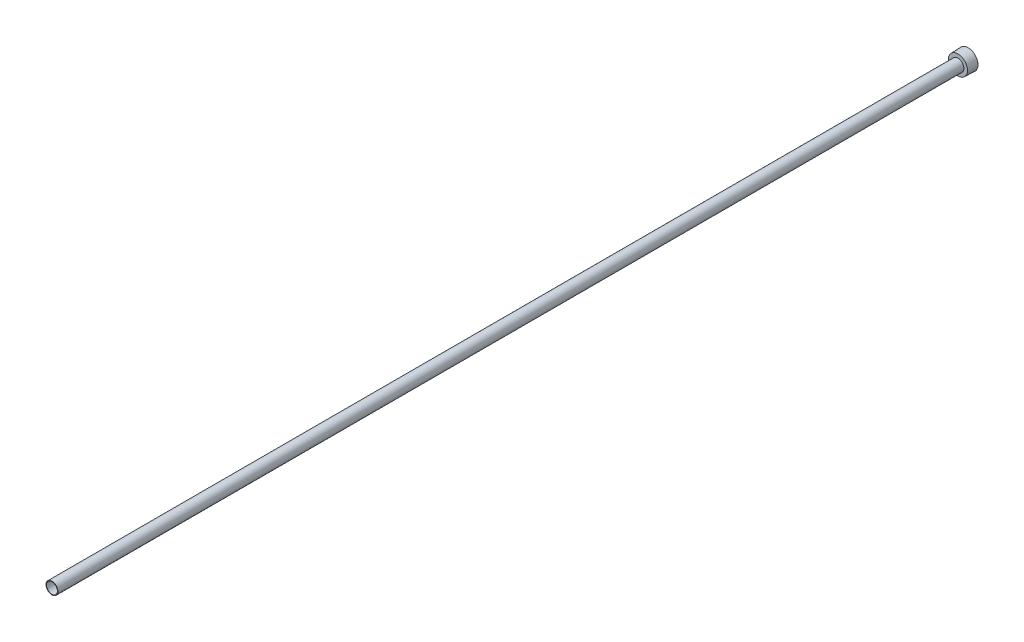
ISO-10303-21;
HEADER;
FILE_DESCRIPTION(('STEP AP214'),'2;1');
FILE_NAME('part.step','',(''),(''),'','','');
FILE_SCHEMA(('AUTOMOTIVE_DESIGN { 1 0 10303 214 1 1 1 1 }'));
ENDSEC;
DATA;
#1=APPLICATION_CONTEXT('core data for automotive mechanical design processes');
#2=APPLICATION_PROTOCOL_DEFINITION('international standard','automotive_design',2000,#1);
#3=PRODUCT_CONTEXT('',#1,'mechanical');
#4=PRODUCT('Part','Part','',(#3));
#5=PRODUCT_RELATED_PRODUCT_CATEGORY('part','',(#4));
#6=PRODUCT_DEFINITION_FORMATION('','',#4);
#7=PRODUCT_DEFINITION_CONTEXT('part definition',#1,'design');
#8=PRODUCT_DEFINITION('design','',#6,#7);
#9=PRODUCT_DEFINITION_SHAPE('','',#8);
#10=(LENGTH_UNIT() NAMED_UNIT(*) SI_UNIT(.MILLI.,.METRE.));
#11=(NAMED_UNIT(*) PLANE_ANGLE_UNIT() SI_UNIT($,.RADIAN.));
#12=(NAMED_UNIT(*) SI_UNIT($,.STERADIAN.) SOLID_ANGLE_UNIT());
#13=UNCERTAINTY_MEASURE_WITH_UNIT(LENGTH_MEASURE(1.E-05),#10,'distance_accuracy_value','');
#14=(GEOMETRIC_REPRESENTATION_CONTEXT(3) GLOBAL_UNCERTAINTY_ASSIGNED_CONTEXT((#13)) GLOBAL_UNIT_ASSIGNED_CONTEXT((#10,
#11,#12)) REPRESENTATION_CONTEXT('',''));
#15=CARTESIAN_POINT('',(0.,0.,0.));
#16=DIRECTION('',(0.,0.,1.));
#17=DIRECTION('',(1.,0.,0.));
#18=AXIS2_PLACEMENT_3D('',#15,#16,#17);
#19=CARTESIAN_POINT('',(0.,0.,0.));
#20=DIRECTION('',(0.,0.,1.));
#21=DIRECTION('',(1.,0.,0.));
#22=AXIS2_PLACEMENT_3D('',#19,#20,#21);
#23=CYLINDRICAL_SURFACE('',#22,7.2263);
#24=CARTESIAN_POINT('',(0.,0.,1219.2));
#25=DIRECTION('',(0.,0.,1.));
#26=DIRECTION('',(1.,0.,0.));
#27=AXIS2_PLACEMENT_3D('',#24,#25,#26);
#28=CIRCLE('',#27,7.2263);
#29=CARTESIAN_POINT('',(7.2263,0.,1219.2));
#30=VERTEX_POINT('',#29);
#31=EDGE_CURVE('E142',#30,#30,#28,.T.);
#32=CARTESIAN_POINT('',(0.,0.,9.525));
#33=DIRECTION('',(0.,0.,-1.));
#34=DIRECTION('',(-1.,0.,0.));
#35=AXIS2_PLACEMENT_3D('',#32,#33,#34);
#36=CIRCLE('',#35,7.2263);
#37=CARTESIAN_POINT('',(7.2263,0.,9.525));
#38=VERTEX_POINT('',#37);
#39=EDGE_CURVE('E37',#38,#38,#36,.F.);
#40=CARTESIAN_POINT('',(7.2263,0.,1219.2));
#41=CARTESIAN_POINT('',(7.2263,0.,1206.59921875));
#42=CARTESIAN_POINT('',(7.2263,0.,1193.9984375));
#43=CARTESIAN_POINT('',(7.2263,0.,1168.796875));
#44=CARTESIAN_POINT('',(7.2263,0.,1156.19609375));
#45=CARTESIAN_POINT('',(7.2263,0.,1130.99453125));
#46=CARTESIAN_POINT('',(7.2263,0.,1118.39375));
#47=CARTESIAN_POINT('',(7.2263,0.,1093.1921875));
#48=CARTESIAN_POINT('',(7.2263,0.,1080.59140625));
#49=CARTESIAN_POINT('',(7.2263,0.,1055.38984375));
#50=CARTESIAN_POINT('',(7.2263,0.,1042.7890625));
#51=CARTESIAN_POINT('',(7.2263,0.,1017.5875));
#52=CARTESIAN_POINT('',(7.2263,0.,1004.98671875));
#53=CARTESIAN_POINT('',(7.2263,0.,979.78515625));
#54=CARTESIAN_POINT('',(7.2263,0.,967.184375));
#55=CARTESIAN_POINT('',(7.2263,0.,941.9828125));
#56=CARTESIAN_POINT('',(7.2263,0.,929.38203125));
#57=CARTESIAN_POINT('',(7.2263,0.,904.18046875));
#58=CARTESIAN_POINT('',(7.2263,0.,891.5796875));
#59=CARTESIAN_POINT('',(7.2263,0.,866.378125));
#60=CARTESIAN_POINT('',(7.2263,0.,853.77734375));
#61=CARTESIAN_POINT('',(7.2263,0.,828.57578125));
#62=CARTESIAN_POINT('',(7.2263,0.,815.975));
#63=CARTESIAN_POINT('',(7.2263,0.,790.7734375));
#64=CARTESIAN_POINT('',(7.2263,0.,778.17265625));
#65=CARTESIAN_POINT('',(7.2263,0.,752.97109375));
#66=CARTESIAN_POINT('',(7.2263,0.,740.3703125));
#67=CARTESIAN_POINT('',(7.2263,0.,715.16875));
#68=CARTESIAN_POINT('',(7.2263,0.,702.56796875));
#69=CARTESIAN_POINT('',(7.2263,0.,677.36640625));
#70=CARTESIAN_POINT('',(7.2263,0.,664.765625));
#71=CARTESIAN_POINT('',(7.2263,0.,639.5640625));
#72=CARTESIAN_POINT('',(7.2263,0.,626.96328125));
#73=CARTESIAN_POINT('',(7.2263,0.,601.76171875));
#74=CARTESIAN_POINT('',(7.2263,0.,589.1609375));
#75=CARTESIAN_POINT('',(7.2263,0.,563.959375));
#76=CARTESIAN_POINT('',(7.2263,0.,551.35859375));
#77=CARTESIAN_POINT('',(7.2263,0.,526.15703125));
#78=CARTESIAN_POINT('',(7.2263,0.,513.55625));
#79=CARTESIAN_POINT('',(7.2263,0.,488.3546875));
#80=CARTESIAN_POINT('',(7.2263,0.,475.75390625));
#81=CARTESIAN_POINT('',(7.2263,0.,450.55234375));
#82=CARTESIAN_POINT('',(7.2263,0.,437.9515625));
#83=CARTESIAN_POINT('',(7.2263,0.,412.75));
#84=CARTESIAN_POINT('',(7.2263,0.,400.14921875));
#85=CARTESIAN_POINT('',(7.2263,0.,374.94765625));
#86=CARTESIAN_POINT('',(7.2263,0.,362.346875));
#87=CARTESIAN_POINT('',(7.2263,0.,337.1453125));
#88=CARTESIAN_POINT('',(7.2263,0.,324.54453125));
#89=CARTESIAN_POINT('',(7.2263,0.,299.34296875));
#90=CARTESIAN_POINT('',(7.2263,0.,286.7421875));
#91=CARTESIAN_POINT('',(7.2263,0.,261.540625));
#92=CARTESIAN_POINT('',(7.2263,0.,248.93984375));
#93=CARTESIAN_POINT('',(7.2263,0.,223.73828125));
#94=CARTESIAN_POINT('',(7.2263,0.,211.1375));
#95=CARTESIAN_POINT('',(7.2263,0.,185.9359375));
#96=CARTESIAN_POINT('',(7.2263,0.,173.33515625));
#97=CARTESIAN_POINT('',(7.2263,0.,148.13359375));
#98=CARTESIAN_POINT('',(7.2263,0.,135.5328125));
#99=CARTESIAN_POINT('',(7.2263,0.,110.33125));
#100=CARTESIAN_POINT('',(7.2263,0.,97.73046875));
#101=CARTESIAN_POINT('',(7.2263,0.,72.52890625));
#102=CARTESIAN_POINT('',(7.2263,0.,59.928125));
#103=CARTESIAN_POINT('',(7.2263,0.,34.7265624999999));
#104=CARTESIAN_POINT('',(7.2263,0.,22.12578125));
#105=CARTESIAN_POINT('',(7.2263,0.,9.525));
#106=B_SPLINE_CURVE_WITH_KNOTS('',3,(#40,#41,#42,#43,#44,#45,#46,#47,#48,#49,#50,#51,#52,#53,
#54,#55,#56,#57,#58,#59,#60,#61,#62,#63,#64,#65,#66,#67,#68,#69,#70,#71,#72,#73,#74,#75,#76,#77,
#78,#79,#80,#81,#82,#83,#84,#85,#86,#87,#88,#89,#90,#91,#92,#93,#94,#95,#96,#97,#98,#99,#100,
#101,#102,#103,#104,#105),.UNSPECIFIED.,.F.,.F.,(4,2,2,2,2,2,2,2,2,2,2,2,2,2,2,2,2,2,2,2,2,2,2,
2,2,2,2,2,2,2,2,2,4),(0.,37.8023437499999,75.6046875,113.40703125,151.209375,189.01171875,
226.8140625,264.61640625,302.41875,340.22109375,378.0234375,415.82578125,453.628125,
491.43046875,529.2328125,567.03515625,604.8375,642.63984375,680.4421875,718.24453125,756.046875,
793.84921875,831.6515625,869.45390625,907.25625,945.05859375,982.8609375,1020.66328125,
1058.465625,1096.26796875,1134.0703125,1171.87265625,1209.675),.UNSPECIFIED.);
#107=EDGE_CURVE('BSEAM33',#30,#38,#106,.T.);
#108=ORIENTED_EDGE('',*,*,#31,.T.);
#109=ORIENTED_EDGE('',*,*,#39,.F.);
#110=ORIENTED_EDGE('',*,*,#107,.T.);
#111=ORIENTED_EDGE('',*,*,#107,.F.);
#112=EDGE_LOOP('',(#108,#110,#109,#111));
#113=FACE_BOUND('',#112,.T.);
#114=ADVANCED_FACE('F33',(#113),#23,.F.);
#115=CARTESIAN_POINT('',(0.,7.93749999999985,1219.2));
#116=DIRECTION('',(0.,0.,-1.));
#117=DIRECTION('',(-1.,0.,0.));
#118=AXIS2_PLACEMENT_3D('',#115,#116,#117);
#119=PLANE('',#118);
#120=ORIENTED_EDGE('',*,*,#31,.F.);
#121=EDGE_LOOP('',(#120));
#122=FACE_BOUND('',#121,.T.);
#123=CARTESIAN_POINT('',(0.,0.,1219.2));
#124=DIRECTION('',(0.,0.,1.));
#125=DIRECTION('',(1.,0.,0.));
#126=AXIS2_PLACEMENT_3D('',#123,#124,#125);
#127=CIRCLE('',#126,7.93749999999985);
#128=CARTESIAN_POINT('',(7.93749999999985,0.,1219.2));
#129=VERTEX_POINT('',#128);
#130=EDGE_CURVE('E145',#129,#129,#127,.T.);
#131=ORIENTED_EDGE('',*,*,#130,.T.);
#132=EDGE_LOOP('',(#131));
#133=FACE_BOUND('',#132,.T.);
#134=ADVANCED_FACE('F35',(#122,#133),#119,.F.);
#135=CARTESIAN_POINT('',(0.,0.,0.));
#136=DIRECTION('',(0.,0.,1.));
#137=DIRECTION('',(1.,0.,0.));
#138=AXIS2_PLACEMENT_3D('',#135,#136,#137);
#139=PLANE('',#138);
#140=DIRECTION('',(-0.866025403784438,0.5,0.));
#141=VECTOR('',#140,1.);
#142=CARTESIAN_POINT('',(0.,-10.9985226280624,0.));
#143=LINE('',#142,#141);
#144=CARTESIAN_POINT('',(0.,-10.9985226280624,0.));
#145=VERTEX_POINT('',#144);
#146=CARTESIAN_POINT('',(-9.525,-5.49926131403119,0.));
#147=VERTEX_POINT('',#146);
#148=EDGE_CURVE('E124',#145,#147,#143,.T.);
#149=ORIENTED_EDGE('',*,*,#148,.F.);
#150=DIRECTION('',(-0.866025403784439,-0.5,0.));
#151=VECTOR('',#150,1.);
#152=CARTESIAN_POINT('',(9.525,-5.49926131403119,0.));
#153=LINE('',#152,#151);
#154=CARTESIAN_POINT('',(9.525,-5.49926131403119,0.));
#155=VERTEX_POINT('',#154);
#156=EDGE_CURVE('E49',#155,#145,#153,.T.);
#157=ORIENTED_EDGE('',*,*,#156,.F.);
#158=DIRECTION('',(0.,-1.,0.));
#159=VECTOR('',#158,1.);
#160=CARTESIAN_POINT('',(9.525,5.49926131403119,0.));
#161=LINE('',#160,#159);
#162=CARTESIAN_POINT('',(9.525,5.49926131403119,0.));
#163=VERTEX_POINT('',#162);
#164=EDGE_CURVE('E133',#163,#155,#161,.T.);
#165=ORIENTED_EDGE('',*,*,#164,.F.);
#166=DIRECTION('',(0.866025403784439,-0.5,0.));
#167=VECTOR('',#166,1.);
#168=CARTESIAN_POINT('',(0.,10.9985226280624,0.));
#169=LINE('',#168,#167);
#170=CARTESIAN_POINT('',(0.,10.9985226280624,0.));
#171=VERTEX_POINT('',#170);
#172=EDGE_CURVE('E131',#171,#163,#169,.T.);
#173=ORIENTED_EDGE('',*,*,#172,.F.);
#174=DIRECTION('',(0.866025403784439,0.5,0.));
#175=VECTOR('',#174,1.);
#176=CARTESIAN_POINT('',(-9.525,5.49926131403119,0.));
#177=LINE('',#176,#175);
#178=CARTESIAN_POINT('',(-9.525,5.49926131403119,0.));
#179=VERTEX_POINT('',#178);
#180=EDGE_CURVE('E97',#179,#171,#177,.T.);
#181=ORIENTED_EDGE('',*,*,#180,.F.);
#182=DIRECTION('',(0.,1.,0.));
#183=VECTOR('',#182,1.);
#184=CARTESIAN_POINT('',(-9.525,-5.49926131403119,0.));
#185=LINE('',#184,#183);
#186=EDGE_CURVE('E127',#147,#179,#185,.T.);
#187=ORIENTED_EDGE('',*,*,#186,.F.);
#188=EDGE_LOOP('',(#149,#157,#165,#173,#181,#187));
#189=FACE_BOUND('',#188,.T.);
#190=CARTESIAN_POINT('',(0.,0.,0.));
#191=DIRECTION('',(0.,0.,1.));
#192=DIRECTION('',(1.,0.,0.));
#193=AXIS2_PLACEMENT_3D('',#190,#191,#192);
#194=CIRCLE('',#193,13.2207);
#195=CARTESIAN_POINT('',(13.2207,0.,0.));
#196=VERTEX_POINT('',#195);
#197=EDGE_CURVE('E11',#196,#196,#194,.T.);
#198=ORIENTED_EDGE('',*,*,#197,.F.);
#199=EDGE_LOOP('',(#198));
#200=FACE_BOUND('',#199,.T.);
#201=ADVANCED_FACE('F159',(#189,#200),#139,.F.);
#202=CARTESIAN_POINT('',(0.,0.,0.));
#203=DIRECTION('',(0.,0.,-1.));
#204=DIRECTION('',(-1.,0.,0.));
#205=AXIS2_PLACEMENT_3D('',#202,#203,#204);
#206=CONICAL_SURFACE('',#205,13.2207,0.0364599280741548);
#207=CARTESIAN_POINT('',(0.,0.,13.4874));
#208=DIRECTION('',(0.,0.,1.));
#209=DIRECTION('',(1.,0.,0.));
#210=AXIS2_PLACEMENT_3D('',#207,#208,#209);
#211=CIRCLE('',#210,12.7287323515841);
#212=CARTESIAN_POINT('',(12.7287323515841,0.,13.4874));
#213=VERTEX_POINT('',#212);
#214=EDGE_CURVE('E42',#213,#213,#211,.T.);
#215=ORIENTED_EDGE('',*,*,#214,.F.);
#216=EDGE_LOOP('',(#215));
#217=FACE_BOUND('',#216,.T.);
#218=ORIENTED_EDGE('',*,*,#197,.T.);
#219=EDGE_LOOP('',(#218));
#220=FACE_BOUND('',#219,.T.);
#221=ADVANCED_FACE('F156',(#217,#220),#206,.T.);
#222=CARTESIAN_POINT('',(0.,12.7287323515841,13.4874));
#223=DIRECTION('',(0.,0.,-1.));
#224=DIRECTION('',(-1.,0.,0.));
#225=AXIS2_PLACEMENT_3D('',#222,#223,#224);
#226=PLANE('',#225);
#227=CARTESIAN_POINT('',(0.,0.,13.4874));
#228=DIRECTION('',(0.,0.,1.));
#229=DIRECTION('',(1.,0.,0.));
#230=AXIS2_PLACEMENT_3D('',#227,#228,#229);
#231=CIRCLE('',#230,7.9375);
#232=CARTESIAN_POINT('',(7.9375,0.,13.4874));
#233=VERTEX_POINT('',#232);
#234=EDGE_CURVE('E148',#233,#233,#231,.T.);
#235=ORIENTED_EDGE('',*,*,#234,.F.);
#236=EDGE_LOOP('',(#235));
#237=FACE_BOUND('',#236,.T.);
#238=ORIENTED_EDGE('',*,*,#214,.T.);
#239=EDGE_LOOP('',(#238));
#240=FACE_BOUND('',#239,.T.);
#241=ADVANCED_FACE('F154',(#237,#240),#226,.F.);
#242=CARTESIAN_POINT('',(0.,0.,278.00111462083));
#243=DIRECTION('',(0.,0.,1.));
#244=DIRECTION('',(1.,0.,0.));
#245=AXIS2_PLACEMENT_3D('',#242,#243,#244);
#246=CYLINDRICAL_SURFACE('',#245,7.93749999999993);
#247=ORIENTED_EDGE('',*,*,#130,.F.);
#248=EDGE_LOOP('',(#247));
#249=FACE_BOUND('',#248,.T.);
#250=ORIENTED_EDGE('',*,*,#234,.T.);
#251=EDGE_LOOP('',(#250));
#252=FACE_BOUND('',#251,.T.);
#253=ADVANCED_FACE('F180',(#249,#252),#246,.T.);
#254=CARTESIAN_POINT('',(0.,-10.9985226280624,9.525));
#255=DIRECTION('',(0.,0.,-1.));
#256=DIRECTION('',(-1.,0.,0.));
#257=AXIS2_PLACEMENT_3D('',#254,#255,#256);
#258=PLANE('',#257);
#259=DIRECTION('',(-0.866025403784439,-0.5,0.));
#260=VECTOR('',#259,1.);
#261=CARTESIAN_POINT('',(9.525,-5.49926131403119,9.525));
#262=LINE('',#261,#260);
#263=CARTESIAN_POINT('',(9.525,-5.49926131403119,9.525));
#264=VERTEX_POINT('',#263);
#265=CARTESIAN_POINT('',(0.,-10.9985226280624,9.525));
#266=VERTEX_POINT('',#265);
#267=EDGE_CURVE('E135',#264,#266,#262,.T.);
#268=ORIENTED_EDGE('',*,*,#267,.T.);
#269=DIRECTION('',(-0.866025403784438,0.5,0.));
#270=VECTOR('',#269,1.);
#271=CARTESIAN_POINT('',(0.,-10.9985226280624,9.525));
#272=LINE('',#271,#270);
#273=CARTESIAN_POINT('',(-9.525,-5.49926131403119,9.525));
#274=VERTEX_POINT('',#273);
#275=EDGE_CURVE('E118',#266,#274,#272,.T.);
#276=ORIENTED_EDGE('',*,*,#275,.T.);
#277=DIRECTION('',(0.,1.,0.));
#278=VECTOR('',#277,1.);
#279=CARTESIAN_POINT('',(-9.525,-5.49926131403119,9.525));
#280=LINE('',#279,#278);
#281=CARTESIAN_POINT('',(-9.525,5.49926131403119,9.525));
#282=VERTEX_POINT('',#281);
#283=EDGE_CURVE('E116',#274,#282,#280,.T.);
#284=ORIENTED_EDGE('',*,*,#283,.T.);
#285=DIRECTION('',(0.866025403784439,0.5,0.));
#286=VECTOR('',#285,1.);
#287=CARTESIAN_POINT('',(-9.525,5.49926131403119,9.525));
#288=LINE('',#287,#286);
#289=CARTESIAN_POINT('',(0.,10.9985226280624,9.525));
#290=VERTEX_POINT('',#289);
#291=EDGE_CURVE('E94',#282,#290,#288,.T.);
#292=ORIENTED_EDGE('',*,*,#291,.T.);
#293=DIRECTION('',(0.866025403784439,-0.5,0.));
#294=VECTOR('',#293,1.);
#295=CARTESIAN_POINT('',(0.,10.9985226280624,9.525));
#296=LINE('',#295,#294);
#297=CARTESIAN_POINT('',(9.525,5.49926131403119,9.525));
#298=VERTEX_POINT('',#297);
#299=EDGE_CURVE('E105',#290,#298,#296,.T.);
#300=ORIENTED_EDGE('',*,*,#299,.T.);
#301=DIRECTION('',(0.,-1.,0.));
#302=VECTOR('',#301,1.);
#303=CARTESIAN_POINT('',(9.525,5.49926131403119,9.525));
#304=LINE('',#303,#302);
#305=EDGE_CURVE('E109',#298,#264,#304,.T.);
#306=ORIENTED_EDGE('',*,*,#305,.T.);
#307=EDGE_LOOP('',(#268,#276,#284,#292,#300,#306));
#308=FACE_BOUND('',#307,.T.);
#309=ORIENTED_EDGE('',*,*,#39,.T.);
#310=EDGE_LOOP('',(#309));
#311=FACE_BOUND('',#310,.T.);
#312=ADVANCED_FACE('F112',(#308,#311),#258,.T.);
#313=CARTESIAN_POINT('',(9.525,-5.49926131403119,9.525));
#314=DIRECTION('',(0.5,-0.866025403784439,0.));
#315=DIRECTION('',(0.866025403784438,0.5,0.));
#316=AXIS2_PLACEMENT_3D('',#313,#314,#315);
#317=PLANE('',#316);
#318=ORIENTED_EDGE('',*,*,#156,.T.);
#319=DIRECTION('',(0.,0.,-1.));
#320=VECTOR('',#319,1.);
#321=CARTESIAN_POINT('',(0.,-10.9985226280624,9.525));
#322=LINE('',#321,#320);
#323=EDGE_CURVE('E79',#266,#145,#322,.T.);
#324=ORIENTED_EDGE('',*,*,#323,.F.);
#325=ORIENTED_EDGE('',*,*,#267,.F.);
#326=DIRECTION('',(0.,0.,-1.));
#327=VECTOR('',#326,1.);
#328=CARTESIAN_POINT('',(9.525,-5.49926131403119,9.525));
#329=LINE('',#328,#327);
#330=EDGE_CURVE('E57',#264,#155,#329,.T.);
#331=ORIENTED_EDGE('',*,*,#330,.T.);
#332=EDGE_LOOP('',(#318,#324,#325,#331));
#333=FACE_BOUND('',#332,.T.);
#334=ADVANCED_FACE('F178',(#333),#317,.F.);
#335=CARTESIAN_POINT('',(9.525,5.49926131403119,9.525));
#336=DIRECTION('',(1.,0.,0.));
#337=DIRECTION('',(0.,0.,-1.));
#338=AXIS2_PLACEMENT_3D('',#335,#336,#337);
#339=PLANE('',#338);
#340=ORIENTED_EDGE('',*,*,#164,.T.);
#341=ORIENTED_EDGE('',*,*,#330,.F.);
#342=ORIENTED_EDGE('',*,*,#305,.F.);
#343=DIRECTION('',(0.,0.,-1.));
#344=VECTOR('',#343,1.);
#345=CARTESIAN_POINT('',(9.525,5.49926131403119,9.525));
#346=LINE('',#345,#344);
#347=EDGE_CURVE('E101',#298,#163,#346,.T.);
#348=ORIENTED_EDGE('',*,*,#347,.T.);
#349=EDGE_LOOP('',(#340,#341,#342,#348));
#350=FACE_BOUND('',#349,.T.);
#351=ADVANCED_FACE('F209',(#350),#339,.F.);
#352=CARTESIAN_POINT('',(0.,10.9985226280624,9.525));
#353=DIRECTION('',(0.5,0.866025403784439,0.));
#354=DIRECTION('',(-0.866025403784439,0.5,0.));
#355=AXIS2_PLACEMENT_3D('',#352,#353,#354);
#356=PLANE('',#355);
#357=ORIENTED_EDGE('',*,*,#172,.T.);
#358=ORIENTED_EDGE('',*,*,#347,.F.);
#359=ORIENTED_EDGE('',*,*,#299,.F.);
#360=DIRECTION('',(0.,0.,-1.));
#361=VECTOR('',#360,1.);
#362=CARTESIAN_POINT('',(0.,10.9985226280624,9.525));
#363=LINE('',#362,#361);
#364=EDGE_CURVE('E90',#290,#171,#363,.T.);
#365=ORIENTED_EDGE('',*,*,#364,.T.);
#366=EDGE_LOOP('',(#357,#358,#359,#365));
#367=FACE_BOUND('',#366,.T.);
#368=ADVANCED_FACE('F106',(#367),#356,.F.);
#369=CARTESIAN_POINT('',(-9.525,5.49926131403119,9.525));
#370=DIRECTION('',(-0.5,0.866025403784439,0.));
#371=DIRECTION('',(-0.866025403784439,-0.5,0.));
#372=AXIS2_PLACEMENT_3D('',#369,#370,#371);
#373=PLANE('',#372);
#374=ORIENTED_EDGE('',*,*,#180,.T.);
#375=ORIENTED_EDGE('',*,*,#364,.F.);
#376=ORIENTED_EDGE('',*,*,#291,.F.);
#377=DIRECTION('',(0.,0.,-1.));
#378=VECTOR('',#377,1.);
#379=CARTESIAN_POINT('',(-9.525,5.49926131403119,9.525));
#380=LINE('',#379,#378);
#381=EDGE_CURVE('E102',#282,#179,#380,.T.);
#382=ORIENTED_EDGE('',*,*,#381,.T.);
#383=EDGE_LOOP('',(#374,#375,#376,#382));
#384=FACE_BOUND('',#383,.T.);
#385=ADVANCED_FACE('F92',(#384),#373,.F.);
#386=CARTESIAN_POINT('',(-9.525,-5.49926131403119,9.525));
#387=DIRECTION('',(-1.,0.,0.));
#388=DIRECTION('',(0.,-1.,0.));
#389=AXIS2_PLACEMENT_3D('',#386,#387,#388);
#390=PLANE('',#389);
#391=ORIENTED_EDGE('',*,*,#186,.T.);
#392=ORIENTED_EDGE('',*,*,#381,.F.);
#393=ORIENTED_EDGE('',*,*,#283,.F.);
#394=DIRECTION('',(0.,0.,-1.));
#395=VECTOR('',#394,1.);
#396=CARTESIAN_POINT('',(-9.525,-5.49926131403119,9.525));
#397=LINE('',#396,#395);
#398=EDGE_CURVE('E139',#274,#147,#397,.T.);
#399=ORIENTED_EDGE('',*,*,#398,.T.);
#400=EDGE_LOOP('',(#391,#392,#393,#399));
#401=FACE_BOUND('',#400,.T.);
#402=ADVANCED_FACE('F227',(#401),#390,.F.);
#403=CARTESIAN_POINT('',(0.,-10.9985226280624,9.525));
#404=DIRECTION('',(-0.5,-0.866025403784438,0.));
#405=DIRECTION('',(0.866025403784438,-0.5,0.));
#406=AXIS2_PLACEMENT_3D('',#403,#404,#405);
#407=PLANE('',#406);
#408=ORIENTED_EDGE('',*,*,#148,.T.);
#409=ORIENTED_EDGE('',*,*,#398,.F.);
#410=ORIENTED_EDGE('',*,*,#275,.F.);
#411=ORIENTED_EDGE('',*,*,#323,.T.);
#412=EDGE_LOOP('',(#408,#409,#410,#411));
#413=FACE_BOUND('',#412,.T.);
#414=ADVANCED_FACE('F234',(#413),#407,.F.);
#415=CLOSED_SHELL('',(#114,#134,#201,#221,#241,#253,#312,#334,#351,#368,#385,#402,#414));
#416=MANIFOLD_SOLID_BREP('B2',#415);
#417=ADVANCED_BREP_SHAPE_REPRESENTATION('',(#18,#416),#14);
#418=SHAPE_DEFINITION_REPRESENTATION(#9,#417);
ENDSEC;
END-ISO-10303-21;
